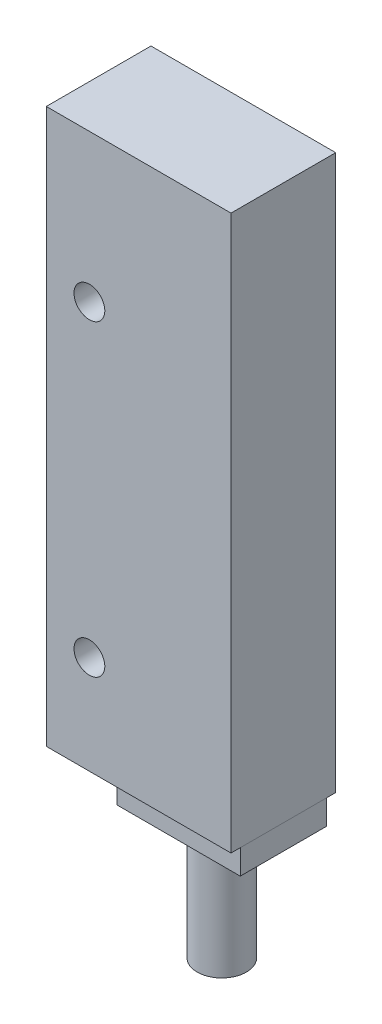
ISO-10303-21;
HEADER;
FILE_DESCRIPTION(('STEP AP214'),'2;1');
FILE_NAME('part.step','',(''),(''),'','','');
FILE_SCHEMA(('AUTOMOTIVE_DESIGN { 1 0 10303 214 1 1 1 1 }'));
ENDSEC;
DATA;
#1=APPLICATION_CONTEXT('core data for automotive mechanical design processes');
#2=APPLICATION_PROTOCOL_DEFINITION('international standard','automotive_design',2000,#1);
#3=PRODUCT_CONTEXT('',#1,'mechanical');
#4=PRODUCT('Part','Part','',(#3));
#5=PRODUCT_RELATED_PRODUCT_CATEGORY('part','',(#4));
#6=PRODUCT_DEFINITION_FORMATION('','',#4);
#7=PRODUCT_DEFINITION_CONTEXT('part definition',#1,'design');
#8=PRODUCT_DEFINITION('design','',#6,#7);
#9=PRODUCT_DEFINITION_SHAPE('','',#8);
#10=(LENGTH_UNIT() NAMED_UNIT(*) SI_UNIT(.MILLI.,.METRE.));
#11=(NAMED_UNIT(*) PLANE_ANGLE_UNIT() SI_UNIT($,.RADIAN.));
#12=(NAMED_UNIT(*) SI_UNIT($,.STERADIAN.) SOLID_ANGLE_UNIT());
#13=UNCERTAINTY_MEASURE_WITH_UNIT(LENGTH_MEASURE(1.E-05),#10,'distance_accuracy_value','');
#14=(GEOMETRIC_REPRESENTATION_CONTEXT(3) GLOBAL_UNCERTAINTY_ASSIGNED_CONTEXT((#13)) GLOBAL_UNIT_ASSIGNED_CONTEXT((#10,
#11,#12)) REPRESENTATION_CONTEXT('',''));
#15=CARTESIAN_POINT('',(0.,0.,0.));
#16=DIRECTION('',(0.,0.,1.));
#17=DIRECTION('',(1.,0.,0.));
#18=AXIS2_PLACEMENT_3D('',#15,#16,#17);
#19=CARTESIAN_POINT('',(2.22044604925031E-13,-24.4999999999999,3.49999999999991));
#20=DIRECTION('',(0.,0.999999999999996,0.));
#21=DIRECTION('',(0.,0.,0.999999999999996));
#22=AXIS2_PLACEMENT_3D('',#19,#20,#21);
#23=PLANE('',#22);
#24=DIRECTION('',(0.999999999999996,0.,0.));
#25=VECTOR('',#24,1.);
#26=CARTESIAN_POINT('',(-1.66533453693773E-13,-24.5,-3.49999999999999));
#27=LINE('',#26,#25);
#28=CARTESIAN_POINT('',(-9.99999999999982,-24.5000000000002,-3.5));
#29=VERTEX_POINT('',#28);
#30=CARTESIAN_POINT('',(-1.66533453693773E-13,-24.5,-3.49999999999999));
#31=VERTEX_POINT('',#30);
#32=EDGE_CURVE('E108',#29,#31,#27,.T.);
#33=ORIENTED_EDGE('',*,*,#32,.T.);
#34=DIRECTION('',(0.,0.,-0.999999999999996));
#35=VECTOR('',#34,1.);
#36=CARTESIAN_POINT('',(2.22044604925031E-13,-24.4999999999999,3.49999999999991));
#37=LINE('',#36,#35);
#38=CARTESIAN_POINT('',(2.22044604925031E-13,-24.4999999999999,3.49999999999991));
#39=VERTEX_POINT('',#38);
#40=EDGE_CURVE('E101',#39,#31,#37,.T.);
#41=ORIENTED_EDGE('',*,*,#40,.F.);
#42=DIRECTION('',(0.999999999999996,0.,0.));
#43=VECTOR('',#42,1.);
#44=CARTESIAN_POINT('',(2.22044604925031E-13,-24.4999999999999,3.49999999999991));
#45=LINE('',#44,#43);
#46=CARTESIAN_POINT('',(-10.,-24.5,3.49999999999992));
#47=VERTEX_POINT('',#46);
#48=EDGE_CURVE('E57',#47,#39,#45,.T.);
#49=ORIENTED_EDGE('',*,*,#48,.F.);
#50=DIRECTION('',(0.,0.,-0.999999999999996));
#51=VECTOR('',#50,1.);
#52=CARTESIAN_POINT('',(-10.,-24.5,3.49999999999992));
#53=LINE('',#52,#51);
#54=EDGE_CURVE('E116',#47,#29,#53,.T.);
#55=ORIENTED_EDGE('',*,*,#54,.T.);
#56=EDGE_LOOP('',(#33,#41,#49,#55));
#57=FACE_BOUND('',#56,.T.);
#58=CARTESIAN_POINT('',(-5.00000000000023,-24.5,0.));
#59=DIRECTION('',(0.,0.999999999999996,0.));
#60=DIRECTION('',(0.,0.,0.999999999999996));
#61=AXIS2_PLACEMENT_3D('',#58,#59,#60);
#62=CIRCLE('',#61,2.);
#63=CARTESIAN_POINT('',(-4.99999999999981,-24.5,1.99999999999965));
#64=VERTEX_POINT('',#63);
#65=EDGE_CURVE('E12',#64,#64,#62,.F.);
#66=ORIENTED_EDGE('',*,*,#65,.F.);
#67=EDGE_LOOP('',(#66));
#68=FACE_BOUND('',#67,.T.);
#69=ADVANCED_FACE('F42',(#57,#68),#23,.F.);
#70=CARTESIAN_POINT('',(0.,-22.5000000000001,3.50000000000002));
#71=DIRECTION('',(-0.999999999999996,0.,0.));
#72=DIRECTION('',(0.,-0.999999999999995,0.));
#73=AXIS2_PLACEMENT_3D('',#70,#71,#72);
#74=PLANE('',#73);
#75=DIRECTION('',(0.,0.999999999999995,0.));
#76=VECTOR('',#75,1.);
#77=CARTESIAN_POINT('',(-2.22044604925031E-13,-22.5,-3.49999999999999));
#78=LINE('',#77,#76);
#79=CARTESIAN_POINT('',(-2.22044604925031E-13,-22.5,-3.49999999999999));
#80=VERTEX_POINT('',#79);
#81=EDGE_CURVE('E88',#31,#80,#78,.T.);
#82=ORIENTED_EDGE('',*,*,#81,.T.);
#83=DIRECTION('',(0.,0.,-0.999999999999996));
#84=VECTOR('',#83,1.);
#85=CARTESIAN_POINT('',(0.,-22.5000000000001,3.50000000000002));
#86=LINE('',#85,#84);
#87=CARTESIAN_POINT('',(0.,-22.5000000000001,3.50000000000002));
#88=VERTEX_POINT('',#87);
#89=EDGE_CURVE('E50',#88,#80,#86,.T.);
#90=ORIENTED_EDGE('',*,*,#89,.F.);
#91=DIRECTION('',(0.,0.999999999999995,0.));
#92=VECTOR('',#91,1.);
#93=CARTESIAN_POINT('',(0.,-22.5000000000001,3.50000000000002));
#94=LINE('',#93,#92);
#95=EDGE_CURVE('E110',#39,#88,#94,.T.);
#96=ORIENTED_EDGE('',*,*,#95,.F.);
#97=ORIENTED_EDGE('',*,*,#40,.T.);
#98=EDGE_LOOP('',(#82,#90,#96,#97));
#99=FACE_BOUND('',#98,.T.);
#100=ADVANCED_FACE('F44',(#99),#74,.F.);
#101=CARTESIAN_POINT('',(0.,-22.5000000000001,3.50000000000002));
#102=DIRECTION('',(0.,-0.999999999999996,0.));
#103=DIRECTION('',(0.,0.,-0.999999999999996));
#104=AXIS2_PLACEMENT_3D('',#101,#102,#103);
#105=PLANE('',#104);
#106=DIRECTION('',(-0.999999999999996,0.,0.));
#107=VECTOR('',#106,1.);
#108=CARTESIAN_POINT('',(-2.22044604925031E-13,-22.5,-3.49999999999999));
#109=LINE('',#108,#107);
#110=CARTESIAN_POINT('',(-10.,-22.5,-3.5));
#111=VERTEX_POINT('',#110);
#112=EDGE_CURVE('E83',#80,#111,#109,.T.);
#113=ORIENTED_EDGE('',*,*,#112,.T.);
#114=DIRECTION('',(0.,0.,-0.999999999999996));
#115=VECTOR('',#114,1.);
#116=CARTESIAN_POINT('',(-10.0000000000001,-22.5000000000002,3.49999999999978));
#117=LINE('',#116,#115);
#118=CARTESIAN_POINT('',(-10.0000000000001,-22.5000000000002,3.49999999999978));
#119=VERTEX_POINT('',#118);
#120=EDGE_CURVE('E99',#119,#111,#117,.T.);
#121=ORIENTED_EDGE('',*,*,#120,.F.);
#122=DIRECTION('',(-0.999999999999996,0.,0.));
#123=VECTOR('',#122,1.);
#124=CARTESIAN_POINT('',(0.,-22.5000000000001,3.50000000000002));
#125=LINE('',#124,#123);
#126=EDGE_CURVE('E96',#88,#119,#125,.T.);
#127=ORIENTED_EDGE('',*,*,#126,.F.);
#128=ORIENTED_EDGE('',*,*,#89,.T.);
#129=EDGE_LOOP('',(#113,#121,#127,#128));
#130=FACE_BOUND('',#129,.T.);
#131=ADVANCED_FACE('F95',(#130),#105,.F.);
#132=CARTESIAN_POINT('',(-10.0000000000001,-22.5000000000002,3.49999999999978));
#133=DIRECTION('',(0.999999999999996,0.,0.));
#134=DIRECTION('',(0.,0.999999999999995,0.));
#135=AXIS2_PLACEMENT_3D('',#132,#133,#134);
#136=PLANE('',#135);
#137=DIRECTION('',(0.,-0.999999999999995,0.));
#138=VECTOR('',#137,1.);
#139=CARTESIAN_POINT('',(-10.,-22.5,-3.5));
#140=LINE('',#139,#138);
#141=EDGE_CURVE('E89',#111,#29,#140,.T.);
#142=ORIENTED_EDGE('',*,*,#141,.T.);
#143=ORIENTED_EDGE('',*,*,#54,.F.);
#144=DIRECTION('',(0.,-0.999999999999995,0.));
#145=VECTOR('',#144,1.);
#146=CARTESIAN_POINT('',(-10.0000000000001,-22.5000000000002,3.49999999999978));
#147=LINE('',#146,#145);
#148=EDGE_CURVE('E62',#119,#47,#147,.T.);
#149=ORIENTED_EDGE('',*,*,#148,.F.);
#150=ORIENTED_EDGE('',*,*,#120,.T.);
#151=EDGE_LOOP('',(#142,#143,#149,#150));
#152=FACE_BOUND('',#151,.T.);
#153=ADVANCED_FACE('F120',(#152),#136,.F.);
#154=CARTESIAN_POINT('',(2.22044604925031E-13,-24.4999999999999,3.49999999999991));
#155=DIRECTION('',(0.,0.,-0.999999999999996));
#156=DIRECTION('',(-0.999999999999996,0.,0.));
#157=AXIS2_PLACEMENT_3D('',#154,#155,#156);
#158=PLANE('',#157);
#159=ORIENTED_EDGE('',*,*,#95,.T.);
#160=ORIENTED_EDGE('',*,*,#126,.T.);
#161=ORIENTED_EDGE('',*,*,#148,.T.);
#162=ORIENTED_EDGE('',*,*,#48,.T.);
#163=EDGE_LOOP('',(#159,#160,#161,#162));
#164=FACE_BOUND('',#163,.T.);
#165=ADVANCED_FACE('F123',(#164),#158,.F.);
#166=CARTESIAN_POINT('',(-1.66533453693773E-13,-24.5,-3.49999999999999));
#167=DIRECTION('',(0.,0.,-0.999999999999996));
#168=DIRECTION('',(-0.999999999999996,0.,0.));
#169=AXIS2_PLACEMENT_3D('',#166,#167,#168);
#170=PLANE('',#169);
#171=ORIENTED_EDGE('',*,*,#81,.F.);
#172=ORIENTED_EDGE('',*,*,#32,.F.);
#173=ORIENTED_EDGE('',*,*,#141,.F.);
#174=ORIENTED_EDGE('',*,*,#112,.F.);
#175=EDGE_LOOP('',(#171,#172,#173,#174));
#176=FACE_BOUND('',#175,.T.);
#177=ADVANCED_FACE('F85',(#176),#170,.T.);
#178=CARTESIAN_POINT('',(-4.99999999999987,-34.5,-3.46944695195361E-13));
#179=DIRECTION('',(0.,0.999999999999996,0.));
#180=DIRECTION('',(0.,0.,0.999999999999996));
#181=AXIS2_PLACEMENT_3D('',#178,#179,#180);
#182=CYLINDRICAL_SURFACE('',#181,2.);
#183=CARTESIAN_POINT('',(-4.99999999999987,-34.5,-3.46944695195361E-13));
#184=DIRECTION('',(0.,-0.999999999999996,0.));
#185=DIRECTION('',(0.,0.,-0.999999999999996));
#186=AXIS2_PLACEMENT_3D('',#183,#184,#185);
#187=CIRCLE('',#186,2.);
#188=CARTESIAN_POINT('',(-4.99999999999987,-34.5,1.99999999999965));
#189=VERTEX_POINT('',#188);
#190=EDGE_CURVE('E102',#189,#189,#187,.T.);
#191=CARTESIAN_POINT('',(-4.99999999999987,-34.5,1.99999999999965));
#192=CARTESIAN_POINT('',(-4.99999999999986,-34.3958333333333,1.99999999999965));
#193=CARTESIAN_POINT('',(-4.99999999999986,-34.2916666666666,1.99999999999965));
#194=CARTESIAN_POINT('',(-4.99999999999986,-34.0833333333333,1.99999999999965));
#195=CARTESIAN_POINT('',(-4.99999999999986,-33.9791666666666,1.99999999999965));
#196=CARTESIAN_POINT('',(-4.99999999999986,-33.7708333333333,1.99999999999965));
#197=CARTESIAN_POINT('',(-4.99999999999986,-33.6666666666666,1.99999999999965));
#198=CARTESIAN_POINT('',(-4.99999999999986,-33.4583333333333,1.99999999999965));
#199=CARTESIAN_POINT('',(-4.99999999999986,-33.3541666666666,1.99999999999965));
#200=CARTESIAN_POINT('',(-4.99999999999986,-33.1458333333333,1.99999999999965));
#201=CARTESIAN_POINT('',(-4.99999999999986,-33.0416666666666,1.99999999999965));
#202=CARTESIAN_POINT('',(-4.99999999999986,-32.8333333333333,1.99999999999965));
#203=CARTESIAN_POINT('',(-4.99999999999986,-32.7291666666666,1.99999999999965));
#204=CARTESIAN_POINT('',(-4.99999999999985,-32.5208333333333,1.99999999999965));
#205=CARTESIAN_POINT('',(-4.99999999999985,-32.4166666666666,1.99999999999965));
#206=CARTESIAN_POINT('',(-4.99999999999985,-32.2083333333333,1.99999999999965));
#207=CARTESIAN_POINT('',(-4.99999999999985,-32.1041666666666,1.99999999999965));
#208=CARTESIAN_POINT('',(-4.99999999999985,-31.8958333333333,1.99999999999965));
#209=CARTESIAN_POINT('',(-4.99999999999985,-31.7916666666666,1.99999999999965));
#210=CARTESIAN_POINT('',(-4.99999999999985,-31.5833333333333,1.99999999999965));
#211=CARTESIAN_POINT('',(-4.99999999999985,-31.4791666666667,1.99999999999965));
#212=CARTESIAN_POINT('',(-4.99999999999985,-31.2708333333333,1.99999999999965));
#213=CARTESIAN_POINT('',(-4.99999999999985,-31.1666666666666,1.99999999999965));
#214=CARTESIAN_POINT('',(-4.99999999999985,-30.9583333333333,1.99999999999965));
#215=CARTESIAN_POINT('',(-4.99999999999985,-30.8541666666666,1.99999999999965));
#216=CARTESIAN_POINT('',(-4.99999999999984,-30.6458333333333,1.99999999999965));
#217=CARTESIAN_POINT('',(-4.99999999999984,-30.5416666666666,1.99999999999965));
#218=CARTESIAN_POINT('',(-4.99999999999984,-30.3333333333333,1.99999999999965));
#219=CARTESIAN_POINT('',(-4.99999999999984,-30.2291666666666,1.99999999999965));
#220=CARTESIAN_POINT('',(-4.99999999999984,-30.0208333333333,1.99999999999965));
#221=CARTESIAN_POINT('',(-4.99999999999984,-29.9166666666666,1.99999999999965));
#222=CARTESIAN_POINT('',(-4.99999999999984,-29.7083333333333,1.99999999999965));
#223=CARTESIAN_POINT('',(-4.99999999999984,-29.6041666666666,1.99999999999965));
#224=CARTESIAN_POINT('',(-4.99999999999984,-29.3958333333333,1.99999999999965));
#225=CARTESIAN_POINT('',(-4.99999999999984,-29.2916666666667,1.99999999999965));
#226=CARTESIAN_POINT('',(-4.99999999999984,-29.0833333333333,1.99999999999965));
#227=CARTESIAN_POINT('',(-4.99999999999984,-28.9791666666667,1.99999999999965));
#228=CARTESIAN_POINT('',(-4.99999999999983,-28.7708333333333,1.99999999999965));
#229=CARTESIAN_POINT('',(-4.99999999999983,-28.6666666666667,1.99999999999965));
#230=CARTESIAN_POINT('',(-4.99999999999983,-28.4583333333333,1.99999999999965));
#231=CARTESIAN_POINT('',(-4.99999999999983,-28.3541666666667,1.99999999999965));
#232=CARTESIAN_POINT('',(-4.99999999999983,-28.1458333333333,1.99999999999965));
#233=CARTESIAN_POINT('',(-4.99999999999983,-28.0416666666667,1.99999999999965));
#234=CARTESIAN_POINT('',(-4.99999999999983,-27.8333333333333,1.99999999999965));
#235=CARTESIAN_POINT('',(-4.99999999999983,-27.7291666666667,1.99999999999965));
#236=CARTESIAN_POINT('',(-4.99999999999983,-27.5208333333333,1.99999999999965));
#237=CARTESIAN_POINT('',(-4.99999999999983,-27.4166666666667,1.99999999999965));
#238=CARTESIAN_POINT('',(-4.99999999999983,-27.2083333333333,1.99999999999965));
#239=CARTESIAN_POINT('',(-4.99999999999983,-27.1041666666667,1.99999999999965));
#240=CARTESIAN_POINT('',(-4.99999999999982,-26.8958333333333,1.99999999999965));
#241=CARTESIAN_POINT('',(-4.99999999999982,-26.7916666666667,1.99999999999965));
#242=CARTESIAN_POINT('',(-4.99999999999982,-26.5833333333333,1.99999999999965));
#243=CARTESIAN_POINT('',(-4.99999999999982,-26.4791666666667,1.99999999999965));
#244=CARTESIAN_POINT('',(-4.99999999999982,-26.2708333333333,1.99999999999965));
#245=CARTESIAN_POINT('',(-4.99999999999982,-26.1666666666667,1.99999999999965));
#246=CARTESIAN_POINT('',(-4.99999999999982,-25.9583333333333,1.99999999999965));
#247=CARTESIAN_POINT('',(-4.99999999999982,-25.8541666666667,1.99999999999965));
#248=CARTESIAN_POINT('',(-4.99999999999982,-25.6458333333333,1.99999999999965));
#249=CARTESIAN_POINT('',(-4.99999999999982,-25.5416666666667,1.99999999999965));
#250=CARTESIAN_POINT('',(-4.99999999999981,-25.3333333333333,1.99999999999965));
#251=CARTESIAN_POINT('',(-4.99999999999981,-25.2291666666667,1.99999999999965));
#252=CARTESIAN_POINT('',(-4.99999999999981,-25.0208333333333,1.99999999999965));
#253=CARTESIAN_POINT('',(-4.99999999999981,-24.9166666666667,1.99999999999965));
#254=CARTESIAN_POINT('',(-4.99999999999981,-24.7083333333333,1.99999999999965));
#255=CARTESIAN_POINT('',(-4.99999999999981,-24.6041666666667,1.99999999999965));
#256=CARTESIAN_POINT('',(-4.99999999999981,-24.5,1.99999999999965));
#257=B_SPLINE_CURVE_WITH_KNOTS('',3,(#191,#192,#193,#194,#195,#196,#197,#198,#199,#200,#201,
#202,#203,#204,#205,#206,#207,#208,#209,#210,#211,#212,#213,#214,#215,#216,#217,#218,#219,#220,
#221,#222,#223,#224,#225,#226,#227,#228,#229,#230,#231,#232,#233,#234,#235,#236,#237,#238,#239,
#240,#241,#242,#243,#244,#245,#246,#247,#248,#249,#250,#251,#252,#253,#254,#255,#256),
.UNSPECIFIED.,.F.,.F.,(4,2,2,2,2,2,2,2,2,2,2,2,2,2,2,2,2,2,2,2,2,2,2,2,2,2,2,2,2,2,2,2,4),(0.,
0.312499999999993,0.624999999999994,0.937499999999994,1.24999999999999,1.56249999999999,
1.87499999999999,2.1875,2.5,2.81249999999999,3.12499999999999,3.43749999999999,3.74999999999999,
4.06249999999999,4.37499999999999,4.68749999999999,4.99999999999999,5.31249999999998,
5.62499999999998,5.93749999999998,6.24999999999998,6.56249999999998,6.87499999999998,
7.18749999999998,7.49999999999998,7.81249999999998,8.12499999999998,8.43749999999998,
8.74999999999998,9.06249999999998,9.37499999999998,9.68749999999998,9.99999999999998),.UNSPECIFIED.);
#258=EDGE_CURVE('BSEAM130',#189,#64,#257,.T.);
#259=ORIENTED_EDGE('',*,*,#190,.F.);
#260=ORIENTED_EDGE('',*,*,#65,.T.);
#261=ORIENTED_EDGE('',*,*,#258,.T.);
#262=ORIENTED_EDGE('',*,*,#258,.F.);
#263=EDGE_LOOP('',(#259,#261,#260,#262));
#264=FACE_BOUND('',#263,.T.);
#265=ADVANCED_FACE('F130',(#264),#182,.T.);
#266=CARTESIAN_POINT('',(-4.99999999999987,-34.5,-3.46944695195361E-13));
#267=DIRECTION('',(0.,-0.999999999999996,0.));
#268=DIRECTION('',(0.,0.,-0.999999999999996));
#269=AXIS2_PLACEMENT_3D('',#266,#267,#268);
#270=PLANE('',#269);
#271=ORIENTED_EDGE('',*,*,#190,.T.);
#272=EDGE_LOOP('',(#271));
#273=FACE_BOUND('',#272,.T.);
#274=ADVANCED_FACE('F167',(#273),#270,.T.);
#275=CLOSED_SHELL('',(#69,#100,#131,#153,#165,#177,#265,#274));
#276=MANIFOLD_SOLID_BREP('B2',#275);
#277=CARTESIAN_POINT('',(-14.9999999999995,22.5,4.25000000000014));
#278=DIRECTION('',(0.999999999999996,0.,0.));
#279=DIRECTION('',(0.,0.,-0.999999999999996));
#280=AXIS2_PLACEMENT_3D('',#277,#278,#279);
#281=PLANE('',#280);
#282=DIRECTION('',(0.,-0.999999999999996,0.));
#283=VECTOR('',#282,1.);
#284=CARTESIAN_POINT('',(-14.9999999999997,22.4999999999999,-4.24999999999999));
#285=LINE('',#284,#283);
#286=CARTESIAN_POINT('',(-14.9999999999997,22.4999999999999,-4.24999999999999));
#287=VERTEX_POINT('',#286);
#288=CARTESIAN_POINT('',(-15.0000000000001,-22.5000000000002,-4.24999999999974));
#289=VERTEX_POINT('',#288);
#290=EDGE_CURVE('E241',#287,#289,#285,.T.);
#291=ORIENTED_EDGE('',*,*,#290,.T.);
#292=DIRECTION('',(0.,0.,-0.999999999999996));
#293=VECTOR('',#292,1.);
#294=CARTESIAN_POINT('',(-15.,-22.5000000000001,4.25000000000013));
#295=LINE('',#294,#293);
#296=CARTESIAN_POINT('',(-15.,-22.5000000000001,4.25000000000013));
#297=VERTEX_POINT('',#296);
#298=EDGE_CURVE('E202',#297,#289,#295,.T.);
#299=ORIENTED_EDGE('',*,*,#298,.F.);
#300=DIRECTION('',(0.,-0.999999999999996,0.));
#301=VECTOR('',#300,1.);
#302=CARTESIAN_POINT('',(-14.9999999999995,22.5,4.25000000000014));
#303=LINE('',#302,#301);
#304=CARTESIAN_POINT('',(-14.9999999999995,22.5,4.25000000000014));
#305=VERTEX_POINT('',#304);
#306=EDGE_CURVE('E266',#305,#297,#303,.T.);
#307=ORIENTED_EDGE('',*,*,#306,.F.);
#308=DIRECTION('',(0.,0.,-0.999999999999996));
#309=VECTOR('',#308,1.);
#310=CARTESIAN_POINT('',(-14.9999999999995,22.5,4.25000000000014));
#311=LINE('',#310,#309);
#312=EDGE_CURVE('E255',#305,#287,#311,.T.);
#313=ORIENTED_EDGE('',*,*,#312,.T.);
#314=EDGE_LOOP('',(#291,#299,#307,#313));
#315=FACE_BOUND('',#314,.T.);
#316=CARTESIAN_POINT('',(-14.9999999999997,17.4999999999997,1.38777878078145E-13));
#317=DIRECTION('',(0.999999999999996,0.,0.));
#318=DIRECTION('',(0.,0.,-0.999999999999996));
#319=AXIS2_PLACEMENT_3D('',#316,#317,#318);
#320=CIRCLE('',#319,2.5);
#321=CARTESIAN_POINT('',(-14.9999999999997,17.4999999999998,-2.50000000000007));
#322=VERTEX_POINT('',#321);
#323=EDGE_CURVE('E40',#322,#322,#320,.F.);
#324=ORIENTED_EDGE('',*,*,#323,.F.);
#325=EDGE_LOOP('',(#324));
#326=FACE_BOUND('',#325,.T.);
#327=ADVANCED_FACE('F195',(#315,#326),#281,.F.);
#328=CARTESIAN_POINT('',(-15.,-22.5000000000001,4.25000000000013));
#329=DIRECTION('',(0.,0.,0.999999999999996));
#330=DIRECTION('',(0.999999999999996,0.,0.));
#331=AXIS2_PLACEMENT_3D('',#328,#329,#330);
#332=PLANE('',#331);
#333=CARTESIAN_POINT('',(-11.4999999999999,10.4999999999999,4.25000000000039));
#334=DIRECTION('',(0.,0.,0.999999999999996));
#335=DIRECTION('',(0.999999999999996,0.,0.));
#336=AXIS2_PLACEMENT_3D('',#333,#334,#335);
#337=CIRCLE('',#336,1.25);
#338=CARTESIAN_POINT('',(-12.7499999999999,10.4999999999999,4.25000000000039));
#339=VERTEX_POINT('',#338);
#340=EDGE_CURVE('E256',#339,#339,#337,.T.);
#341=ORIENTED_EDGE('',*,*,#340,.F.);
#342=EDGE_LOOP('',(#341));
#343=FACE_BOUND('',#342,.T.);
#344=ORIENTED_EDGE('',*,*,#306,.T.);
#345=DIRECTION('',(0.999999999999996,0.,0.));
#346=VECTOR('',#345,1.);
#347=CARTESIAN_POINT('',(-15.,-22.5000000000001,4.25000000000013));
#348=LINE('',#347,#346);
#349=CARTESIAN_POINT('',(-2.22044604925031E-13,-22.4999999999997,4.25));
#350=VERTEX_POINT('',#349);
#351=EDGE_CURVE('E249',#297,#350,#348,.T.);
#352=ORIENTED_EDGE('',*,*,#351,.T.);
#353=DIRECTION('',(0.,0.999999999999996,0.));
#354=VECTOR('',#353,1.);
#355=CARTESIAN_POINT('',(0.,22.5,4.25000000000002));
#356=LINE('',#355,#354);
#357=CARTESIAN_POINT('',(0.,22.5,4.25000000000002));
#358=VERTEX_POINT('',#357);
#359=EDGE_CURVE('E214',#350,#358,#356,.T.);
#360=ORIENTED_EDGE('',*,*,#359,.T.);
#361=DIRECTION('',(-0.999999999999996,0.,0.));
#362=VECTOR('',#361,1.);
#363=CARTESIAN_POINT('',(-14.9999999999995,22.5,4.25000000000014));
#364=LINE('',#363,#362);
#365=EDGE_CURVE('E209',#358,#305,#364,.T.);
#366=ORIENTED_EDGE('',*,*,#365,.T.);
#367=EDGE_LOOP('',(#344,#352,#360,#366));
#368=FACE_BOUND('',#367,.T.);
#369=CARTESIAN_POINT('',(-11.5,-14.5000000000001,4.24999999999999));
#370=DIRECTION('',(0.,0.,0.999999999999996));
#371=DIRECTION('',(0.999999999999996,0.,0.));
#372=AXIS2_PLACEMENT_3D('',#369,#370,#371);
#373=CIRCLE('',#372,1.25);
#374=CARTESIAN_POINT('',(-12.75,-14.5000000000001,4.24999999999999));
#375=VERTEX_POINT('',#374);
#376=EDGE_CURVE('E286',#375,#375,#373,.T.);
#377=ORIENTED_EDGE('',*,*,#376,.F.);
#378=EDGE_LOOP('',(#377));
#379=FACE_BOUND('',#378,.T.);
#380=ADVANCED_FACE('F279',(#343,#368,#379),#332,.T.);
#381=CARTESIAN_POINT('',(-15.0000000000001,-22.5000000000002,-4.24999999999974));
#382=DIRECTION('',(0.,0.,0.999999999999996));
#383=DIRECTION('',(0.999999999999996,0.,0.));
#384=AXIS2_PLACEMENT_3D('',#381,#382,#383);
#385=PLANE('',#384);
#386=CARTESIAN_POINT('',(-11.5000000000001,10.5,-4.25000000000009));
#387=DIRECTION('',(0.,0.,0.999999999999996));
#388=DIRECTION('',(0.999999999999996,0.,0.));
#389=AXIS2_PLACEMENT_3D('',#386,#387,#388);
#390=CIRCLE('',#389,1.25);
#391=CARTESIAN_POINT('',(-12.7499999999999,10.4999999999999,-4.25000000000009));
#392=VERTEX_POINT('',#391);
#393=EDGE_CURVE('E259',#392,#392,#390,.T.);
#394=ORIENTED_EDGE('',*,*,#393,.T.);
#395=EDGE_LOOP('',(#394));
#396=FACE_BOUND('',#395,.T.);
#397=ORIENTED_EDGE('',*,*,#290,.F.);
#398=DIRECTION('',(-0.999999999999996,0.,0.));
#399=VECTOR('',#398,1.);
#400=CARTESIAN_POINT('',(-14.9999999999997,22.4999999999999,-4.24999999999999));
#401=LINE('',#400,#399);
#402=CARTESIAN_POINT('',(2.4980018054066E-13,22.5,-4.25));
#403=VERTEX_POINT('',#402);
#404=EDGE_CURVE('E264',#403,#287,#401,.T.);
#405=ORIENTED_EDGE('',*,*,#404,.F.);
#406=DIRECTION('',(0.,0.999999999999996,0.));
#407=VECTOR('',#406,1.);
#408=CARTESIAN_POINT('',(2.4980018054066E-13,22.5,-4.25));
#409=LINE('',#408,#407);
#410=CARTESIAN_POINT('',(0.,-22.4999999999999,-4.24999999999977));
#411=VERTEX_POINT('',#410);
#412=EDGE_CURVE('E242',#411,#403,#409,.T.);
#413=ORIENTED_EDGE('',*,*,#412,.F.);
#414=DIRECTION('',(0.999999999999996,0.,0.));
#415=VECTOR('',#414,1.);
#416=CARTESIAN_POINT('',(-15.0000000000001,-22.5000000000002,-4.24999999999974));
#417=LINE('',#416,#415);
#418=EDGE_CURVE('E235',#289,#411,#417,.T.);
#419=ORIENTED_EDGE('',*,*,#418,.F.);
#420=EDGE_LOOP('',(#397,#405,#413,#419));
#421=FACE_BOUND('',#420,.T.);
#422=CARTESIAN_POINT('',(-11.4999999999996,-14.4999999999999,-4.24999999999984));
#423=DIRECTION('',(0.,0.,0.999999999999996));
#424=DIRECTION('',(0.999999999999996,0.,0.));
#425=AXIS2_PLACEMENT_3D('',#422,#423,#424);
#426=CIRCLE('',#425,1.25);
#427=CARTESIAN_POINT('',(-12.75,-14.5000000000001,-4.24999999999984));
#428=VERTEX_POINT('',#427);
#429=EDGE_CURVE('E288',#428,#428,#426,.T.);
#430=ORIENTED_EDGE('',*,*,#429,.T.);
#431=EDGE_LOOP('',(#430));
#432=FACE_BOUND('',#431,.T.);
#433=ADVANCED_FACE('F237',(#396,#421,#432),#385,.F.);
#434=CARTESIAN_POINT('',(-15.,-22.5000000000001,4.25000000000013));
#435=DIRECTION('',(0.,0.999999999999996,0.));
#436=DIRECTION('',(0.,0.,0.999999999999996));
#437=AXIS2_PLACEMENT_3D('',#434,#435,#436);
#438=PLANE('',#437);
#439=ORIENTED_EDGE('',*,*,#418,.T.);
#440=DIRECTION('',(0.,0.,-0.999999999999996));
#441=VECTOR('',#440,1.);
#442=CARTESIAN_POINT('',(-2.22044604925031E-13,-22.4999999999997,4.25));
#443=LINE('',#442,#441);
#444=EDGE_CURVE('E252',#350,#411,#443,.T.);
#445=ORIENTED_EDGE('',*,*,#444,.F.);
#446=ORIENTED_EDGE('',*,*,#351,.F.);
#447=ORIENTED_EDGE('',*,*,#298,.T.);
#448=EDGE_LOOP('',(#439,#445,#446,#447));
#449=FACE_BOUND('',#448,.T.);
#450=ADVANCED_FACE('F248',(#449),#438,.F.);
#451=CARTESIAN_POINT('',(0.,22.5,4.25000000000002));
#452=DIRECTION('',(-0.999999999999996,0.,0.));
#453=DIRECTION('',(0.,0.,0.999999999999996));
#454=AXIS2_PLACEMENT_3D('',#451,#452,#453);
#455=PLANE('',#454);
#456=ORIENTED_EDGE('',*,*,#412,.T.);
#457=DIRECTION('',(0.,0.,-0.999999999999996));
#458=VECTOR('',#457,1.);
#459=CARTESIAN_POINT('',(0.,22.5,4.25000000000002));
#460=LINE('',#459,#458);
#461=EDGE_CURVE('E272',#358,#403,#460,.T.);
#462=ORIENTED_EDGE('',*,*,#461,.F.);
#463=ORIENTED_EDGE('',*,*,#359,.F.);
#464=ORIENTED_EDGE('',*,*,#444,.T.);
#465=EDGE_LOOP('',(#456,#462,#463,#464));
#466=FACE_BOUND('',#465,.T.);
#467=ADVANCED_FACE('F276',(#466),#455,.F.);
#468=CARTESIAN_POINT('',(-14.9999999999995,22.5,4.25000000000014));
#469=DIRECTION('',(0.,-0.999999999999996,0.));
#470=DIRECTION('',(0.,0.,-0.999999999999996));
#471=AXIS2_PLACEMENT_3D('',#468,#469,#470);
#472=PLANE('',#471);
#473=ORIENTED_EDGE('',*,*,#404,.T.);
#474=ORIENTED_EDGE('',*,*,#312,.F.);
#475=ORIENTED_EDGE('',*,*,#365,.F.);
#476=ORIENTED_EDGE('',*,*,#461,.T.);
#477=EDGE_LOOP('',(#473,#474,#475,#476));
#478=FACE_BOUND('',#477,.T.);
#479=ADVANCED_FACE('F278',(#478),#472,.F.);
#480=CARTESIAN_POINT('',(-11.4999999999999,10.4999999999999,4.25000000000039));
#481=DIRECTION('',(0.,0.,-0.999999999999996));
#482=DIRECTION('',(-0.999999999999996,0.,0.));
#483=AXIS2_PLACEMENT_3D('',#480,#481,#482);
#484=CYLINDRICAL_SURFACE('',#483,1.25);
#485=CARTESIAN_POINT('',(-12.7499999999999,10.4999999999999,4.25000000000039));
#486=CARTESIAN_POINT('',(-12.7499999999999,10.4999999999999,4.16145833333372));
#487=CARTESIAN_POINT('',(-12.7499999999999,10.4999999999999,4.07291666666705));
#488=CARTESIAN_POINT('',(-12.7499999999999,10.4999999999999,3.89583333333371));
#489=CARTESIAN_POINT('',(-12.7499999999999,10.4999999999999,3.80729166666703));
#490=CARTESIAN_POINT('',(-12.7499999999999,10.4999999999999,3.63020833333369));
#491=CARTESIAN_POINT('',(-12.7499999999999,10.4999999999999,3.54166666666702));
#492=CARTESIAN_POINT('',(-12.7499999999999,10.4999999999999,3.36458333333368));
#493=CARTESIAN_POINT('',(-12.7499999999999,10.4999999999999,3.276041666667));
#494=CARTESIAN_POINT('',(-12.7499999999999,10.4999999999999,3.09895833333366));
#495=CARTESIAN_POINT('',(-12.7499999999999,10.4999999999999,3.01041666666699));
#496=CARTESIAN_POINT('',(-12.7499999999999,10.4999999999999,2.83333333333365));
#497=CARTESIAN_POINT('',(-12.7499999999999,10.4999999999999,2.74479166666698));
#498=CARTESIAN_POINT('',(-12.7499999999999,10.4999999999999,2.56770833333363));
#499=CARTESIAN_POINT('',(-12.7499999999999,10.4999999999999,2.47916666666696));
#500=CARTESIAN_POINT('',(-12.7499999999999,10.4999999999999,2.30208333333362));
#501=CARTESIAN_POINT('',(-12.7499999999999,10.4999999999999,2.21354166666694));
#502=CARTESIAN_POINT('',(-12.7499999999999,10.4999999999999,2.0364583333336));
#503=CARTESIAN_POINT('',(-12.7499999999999,10.4999999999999,1.94791666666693));
#504=CARTESIAN_POINT('',(-12.7499999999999,10.4999999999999,1.77083333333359));
#505=CARTESIAN_POINT('',(-12.7499999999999,10.4999999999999,1.68229166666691));
#506=CARTESIAN_POINT('',(-12.7499999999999,10.4999999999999,1.50520833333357));
#507=CARTESIAN_POINT('',(-12.7499999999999,10.4999999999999,1.4166666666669));
#508=CARTESIAN_POINT('',(-12.7499999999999,10.4999999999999,1.23958333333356));
#509=CARTESIAN_POINT('',(-12.7499999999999,10.4999999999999,1.15104166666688));
#510=CARTESIAN_POINT('',(-12.7499999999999,10.4999999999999,0.973958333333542));
#511=CARTESIAN_POINT('',(-12.7499999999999,10.4999999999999,0.88541666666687));
#512=CARTESIAN_POINT('',(-12.7499999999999,10.4999999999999,0.708333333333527));
#513=CARTESIAN_POINT('',(-12.7499999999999,10.4999999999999,0.619791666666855));
#514=CARTESIAN_POINT('',(-12.7499999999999,10.4999999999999,0.442708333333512));
#515=CARTESIAN_POINT('',(-12.7499999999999,10.4999999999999,0.35416666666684));
#516=CARTESIAN_POINT('',(-12.7499999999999,10.4999999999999,0.177083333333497));
#517=CARTESIAN_POINT('',(-12.7499999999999,10.4999999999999,0.0885416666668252));
#518=CARTESIAN_POINT('',(-12.7499999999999,10.4999999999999,-0.0885416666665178));
#519=CARTESIAN_POINT('',(-12.7499999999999,10.4999999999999,-0.177083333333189));
#520=CARTESIAN_POINT('',(-12.7499999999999,10.4999999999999,-0.354166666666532));
#521=CARTESIAN_POINT('',(-12.7499999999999,10.4999999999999,-0.442708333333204));
#522=CARTESIAN_POINT('',(-12.7499999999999,10.4999999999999,-0.619791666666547));
#523=CARTESIAN_POINT('',(-12.7499999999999,10.4999999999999,-0.708333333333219));
#524=CARTESIAN_POINT('',(-12.7499999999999,10.4999999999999,-0.885416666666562));
#525=CARTESIAN_POINT('',(-12.7499999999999,10.4999999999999,-0.973958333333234));
#526=CARTESIAN_POINT('',(-12.7499999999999,10.4999999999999,-1.15104166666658));
#527=CARTESIAN_POINT('',(-12.7499999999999,10.4999999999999,-1.23958333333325));
#528=CARTESIAN_POINT('',(-12.7499999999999,10.4999999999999,-1.41666666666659));
#529=CARTESIAN_POINT('',(-12.7499999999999,10.4999999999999,-1.50520833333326));
#530=CARTESIAN_POINT('',(-12.7499999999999,10.4999999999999,-1.68229166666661));
#531=CARTESIAN_POINT('',(-12.7499999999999,10.4999999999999,-1.77083333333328));
#532=CARTESIAN_POINT('',(-12.7499999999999,10.4999999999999,-1.94791666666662));
#533=CARTESIAN_POINT('',(-12.7499999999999,10.4999999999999,-2.03645833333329));
#534=CARTESIAN_POINT('',(-12.7499999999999,10.4999999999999,-2.21354166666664));
#535=CARTESIAN_POINT('',(-12.7499999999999,10.4999999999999,-2.30208333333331));
#536=CARTESIAN_POINT('',(-12.7499999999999,10.4999999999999,-2.47916666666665));
#537=CARTESIAN_POINT('',(-12.7499999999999,10.4999999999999,-2.56770833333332));
#538=CARTESIAN_POINT('',(-12.7499999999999,10.4999999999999,-2.74479166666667));
#539=CARTESIAN_POINT('',(-12.7499999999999,10.4999999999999,-2.83333333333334));
#540=CARTESIAN_POINT('',(-12.7499999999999,10.4999999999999,-3.01041666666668));
#541=CARTESIAN_POINT('',(-12.7499999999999,10.4999999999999,-3.09895833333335));
#542=CARTESIAN_POINT('',(-12.7499999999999,10.4999999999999,-3.2760416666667));
#543=CARTESIAN_POINT('',(-12.7499999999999,10.4999999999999,-3.36458333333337));
#544=CARTESIAN_POINT('',(-12.7499999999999,10.4999999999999,-3.54166666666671));
#545=CARTESIAN_POINT('',(-12.7499999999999,10.4999999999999,-3.63020833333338));
#546=CARTESIAN_POINT('',(-12.7499999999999,10.4999999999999,-3.80729166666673));
#547=CARTESIAN_POINT('',(-12.7499999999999,10.4999999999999,-3.8958333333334));
#548=CARTESIAN_POINT('',(-12.7499999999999,10.4999999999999,-4.07291666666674));
#549=CARTESIAN_POINT('',(-12.7499999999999,10.4999999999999,-4.16145833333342));
#550=CARTESIAN_POINT('',(-12.7499999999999,10.4999999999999,-4.25000000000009));
#551=B_SPLINE_CURVE_WITH_KNOTS('',3,(#485,#486,#487,#488,#489,#490,#491,#492,#493,#494,#495,
#496,#497,#498,#499,#500,#501,#502,#503,#504,#505,#506,#507,#508,#509,#510,#511,#512,#513,#514,
#515,#516,#517,#518,#519,#520,#521,#522,#523,#524,#525,#526,#527,#528,#529,#530,#531,#532,#533,
#534,#535,#536,#537,#538,#539,#540,#541,#542,#543,#544,#545,#546,#547,#548,#549,#550),
.UNSPECIFIED.,.F.,.F.,(4,2,2,2,2,2,2,2,2,2,2,2,2,2,2,2,2,2,2,2,2,2,2,2,2,2,2,2,2,2,2,2,4),(0.,
0.265625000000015,0.53125000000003,0.796875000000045,1.06250000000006,1.32812500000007,
1.59375000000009,1.85937500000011,2.12500000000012,2.39062500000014,2.65625000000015,
2.92187500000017,3.18750000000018,3.45312500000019,3.71875000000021,3.98437500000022,
4.25000000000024,4.51562500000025,4.78125000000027,5.04687500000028,5.3125000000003,
5.57812500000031,5.84375000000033,6.10937500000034,6.37500000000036,6.64062500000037,
6.90625000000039,7.1718750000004,7.43750000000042,7.70312500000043,7.96875000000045,
8.23437500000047,8.50000000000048),.UNSPECIFIED.);
#552=EDGE_CURVE('BSEAM337',#339,#392,#551,.T.);
#553=ORIENTED_EDGE('',*,*,#340,.T.);
#554=ORIENTED_EDGE('',*,*,#393,.F.);
#555=ORIENTED_EDGE('',*,*,#552,.T.);
#556=ORIENTED_EDGE('',*,*,#552,.F.);
#557=EDGE_LOOP('',(#553,#555,#554,#556));
#558=FACE_BOUND('',#557,.T.);
#559=ADVANCED_FACE('F337',(#558),#484,.F.);
#560=CARTESIAN_POINT('',(-11.5,-14.5000000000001,4.24999999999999));
#561=DIRECTION('',(0.,0.,-0.999999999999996));
#562=DIRECTION('',(-0.999999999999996,0.,0.));
#563=AXIS2_PLACEMENT_3D('',#560,#561,#562);
#564=CYLINDRICAL_SURFACE('',#563,1.25);
#565=CARTESIAN_POINT('',(-12.75,-14.5000000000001,4.24999999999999));
#566=CARTESIAN_POINT('',(-12.75,-14.5000000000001,4.16145833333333));
#567=CARTESIAN_POINT('',(-12.75,-14.5000000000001,4.07291666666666));
#568=CARTESIAN_POINT('',(-12.75,-14.5000000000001,3.89583333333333));
#569=CARTESIAN_POINT('',(-12.75,-14.5000000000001,3.80729166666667));
#570=CARTESIAN_POINT('',(-12.75,-14.5000000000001,3.63020833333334));
#571=CARTESIAN_POINT('',(-12.75,-14.5000000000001,3.54166666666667));
#572=CARTESIAN_POINT('',(-12.75,-14.5000000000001,3.36458333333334));
#573=CARTESIAN_POINT('',(-12.75,-14.5000000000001,3.27604166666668));
#574=CARTESIAN_POINT('',(-12.75,-14.5000000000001,3.09895833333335));
#575=CARTESIAN_POINT('',(-12.75,-14.5000000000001,3.01041666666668));
#576=CARTESIAN_POINT('',(-12.75,-14.5000000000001,2.83333333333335));
#577=CARTESIAN_POINT('',(-12.75,-14.5000000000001,2.74479166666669));
#578=CARTESIAN_POINT('',(-12.75,-14.5000000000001,2.56770833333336));
#579=CARTESIAN_POINT('',(-12.75,-14.5000000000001,2.47916666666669));
#580=CARTESIAN_POINT('',(-12.75,-14.5000000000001,2.30208333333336));
#581=CARTESIAN_POINT('',(-12.75,-14.5000000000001,2.2135416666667));
#582=CARTESIAN_POINT('',(-12.75,-14.5000000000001,2.03645833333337));
#583=CARTESIAN_POINT('',(-12.75,-14.5000000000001,1.9479166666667));
#584=CARTESIAN_POINT('',(-12.75,-14.5000000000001,1.77083333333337));
#585=CARTESIAN_POINT('',(-12.75,-14.5000000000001,1.68229166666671));
#586=CARTESIAN_POINT('',(-12.75,-14.5000000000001,1.50520833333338));
#587=CARTESIAN_POINT('',(-12.75,-14.5000000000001,1.41666666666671));
#588=CARTESIAN_POINT('',(-12.75,-14.5000000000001,1.23958333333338));
#589=CARTESIAN_POINT('',(-12.75,-14.5000000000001,1.15104166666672));
#590=CARTESIAN_POINT('',(-12.75,-14.5000000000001,0.973958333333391));
#591=CARTESIAN_POINT('',(-12.75,-14.5000000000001,0.885416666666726));
#592=CARTESIAN_POINT('',(-12.75,-14.5000000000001,0.708333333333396));
#593=CARTESIAN_POINT('',(-12.75,-14.5000000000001,0.619791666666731));
#594=CARTESIAN_POINT('',(-12.75,-14.5000000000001,0.442708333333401));
#595=CARTESIAN_POINT('',(-12.75,-14.5000000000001,0.354166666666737));
#596=CARTESIAN_POINT('',(-12.75,-14.5000000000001,0.177083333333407));
#597=CARTESIAN_POINT('',(-12.75,-14.5000000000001,0.0885416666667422));
#598=CARTESIAN_POINT('',(-12.75,-14.5000000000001,-0.0885416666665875));
#599=CARTESIAN_POINT('',(-12.75,-14.5000000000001,-0.177083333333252));
#600=CARTESIAN_POINT('',(-12.75,-14.5000000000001,-0.354166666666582));
#601=CARTESIAN_POINT('',(-12.75,-14.5000000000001,-0.442708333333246));
#602=CARTESIAN_POINT('',(-12.75,-14.5000000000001,-0.619791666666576));
#603=CARTESIAN_POINT('',(-12.75,-14.5000000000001,-0.708333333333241));
#604=CARTESIAN_POINT('',(-12.75,-14.5000000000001,-0.885416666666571));
#605=CARTESIAN_POINT('',(-12.75,-14.5000000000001,-0.973958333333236));
#606=CARTESIAN_POINT('',(-12.75,-14.5000000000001,-1.15104166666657));
#607=CARTESIAN_POINT('',(-12.75,-14.5000000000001,-1.23958333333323));
#608=CARTESIAN_POINT('',(-12.75,-14.5000000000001,-1.41666666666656));
#609=CARTESIAN_POINT('',(-12.75,-14.5000000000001,-1.50520833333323));
#610=CARTESIAN_POINT('',(-12.75,-14.5000000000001,-1.68229166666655));
#611=CARTESIAN_POINT('',(-12.75,-14.5000000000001,-1.77083333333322));
#612=CARTESIAN_POINT('',(-12.75,-14.5000000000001,-1.94791666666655));
#613=CARTESIAN_POINT('',(-12.75,-14.5000000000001,-2.03645833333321));
#614=CARTESIAN_POINT('',(-12.75,-14.5000000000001,-2.21354166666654));
#615=CARTESIAN_POINT('',(-12.75,-14.5000000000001,-2.30208333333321));
#616=CARTESIAN_POINT('',(-12.75,-14.5000000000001,-2.47916666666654));
#617=CARTESIAN_POINT('',(-12.75,-14.5000000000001,-2.5677083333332));
#618=CARTESIAN_POINT('',(-12.75,-14.5000000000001,-2.74479166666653));
#619=CARTESIAN_POINT('',(-12.75,-14.5000000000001,-2.8333333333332));
#620=CARTESIAN_POINT('',(-12.75,-14.5000000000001,-3.01041666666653));
#621=CARTESIAN_POINT('',(-12.75,-14.5000000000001,-3.09895833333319));
#622=CARTESIAN_POINT('',(-12.75,-14.5000000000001,-3.27604166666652));
#623=CARTESIAN_POINT('',(-12.75,-14.5000000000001,-3.36458333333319));
#624=CARTESIAN_POINT('',(-12.75,-14.5000000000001,-3.54166666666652));
#625=CARTESIAN_POINT('',(-12.75,-14.5000000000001,-3.63020833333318));
#626=CARTESIAN_POINT('',(-12.75,-14.5000000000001,-3.80729166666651));
#627=CARTESIAN_POINT('',(-12.75,-14.5000000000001,-3.89583333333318));
#628=CARTESIAN_POINT('',(-12.75,-14.5000000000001,-4.07291666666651));
#629=CARTESIAN_POINT('',(-12.75,-14.5000000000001,-4.16145833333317));
#630=CARTESIAN_POINT('',(-12.75,-14.5000000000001,-4.24999999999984));
#631=B_SPLINE_CURVE_WITH_KNOTS('',3,(#565,#566,#567,#568,#569,#570,#571,#572,#573,#574,#575,
#576,#577,#578,#579,#580,#581,#582,#583,#584,#585,#586,#587,#588,#589,#590,#591,#592,#593,#594,
#595,#596,#597,#598,#599,#600,#601,#602,#603,#604,#605,#606,#607,#608,#609,#610,#611,#612,#613,
#614,#615,#616,#617,#618,#619,#620,#621,#622,#623,#624,#625,#626,#627,#628,#629,#630),
.UNSPECIFIED.,.F.,.F.,(4,2,2,2,2,2,2,2,2,2,2,2,2,2,2,2,2,2,2,2,2,2,2,2,2,2,2,2,2,2,2,2,4),(0.,
0.265624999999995,0.53124999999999,0.796874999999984,1.06249999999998,1.32812499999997,
1.59374999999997,1.85937499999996,2.12499999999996,2.39062499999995,2.65624999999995,
2.92187499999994,3.18749999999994,3.45312499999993,3.71874999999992,3.98437499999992,
4.24999999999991,4.51562499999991,4.7812499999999,5.0468749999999,5.31249999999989,
5.57812499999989,5.84374999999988,6.10937499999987,6.37499999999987,6.64062499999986,
6.90624999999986,7.17187499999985,7.43749999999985,7.70312499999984,7.96874999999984,
8.23437499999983,8.49999999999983),.UNSPECIFIED.);
#632=EDGE_CURVE('BSEAM303',#375,#428,#631,.T.);
#633=ORIENTED_EDGE('',*,*,#376,.T.);
#634=ORIENTED_EDGE('',*,*,#429,.F.);
#635=ORIENTED_EDGE('',*,*,#632,.T.);
#636=ORIENTED_EDGE('',*,*,#632,.F.);
#637=EDGE_LOOP('',(#633,#635,#634,#636));
#638=FACE_BOUND('',#637,.T.);
#639=ADVANCED_FACE('F303',(#638),#564,.F.);
#640=CARTESIAN_POINT('',(-15.4999999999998,17.4999999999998,0.));
#641=DIRECTION('',(0.999999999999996,0.,0.));
#642=DIRECTION('',(0.,0.,-0.999999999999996));
#643=AXIS2_PLACEMENT_3D('',#640,#641,#642);
#644=CYLINDRICAL_SURFACE('',#643,2.5);
#645=CARTESIAN_POINT('',(-15.4999999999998,17.4999999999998,0.));
#646=DIRECTION('',(-0.999999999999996,0.,0.));
#647=DIRECTION('',(0.,0.,0.999999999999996));
#648=AXIS2_PLACEMENT_3D('',#645,#646,#647);
#649=CIRCLE('',#648,2.5);
#650=CARTESIAN_POINT('',(-15.4999999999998,17.4999999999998,-2.50000000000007));
#651=VERTEX_POINT('',#650);
#652=EDGE_CURVE('E292',#651,#651,#649,.T.);
#653=CARTESIAN_POINT('',(-15.4999999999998,17.4999999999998,-2.50000000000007));
#654=CARTESIAN_POINT('',(-15.4947916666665,17.4999999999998,-2.50000000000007));
#655=CARTESIAN_POINT('',(-15.4895833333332,17.4999999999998,-2.50000000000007));
#656=CARTESIAN_POINT('',(-15.4791666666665,17.4999999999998,-2.50000000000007));
#657=CARTESIAN_POINT('',(-15.4739583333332,17.4999999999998,-2.50000000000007));
#658=CARTESIAN_POINT('',(-15.4635416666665,17.4999999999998,-2.50000000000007));
#659=CARTESIAN_POINT('',(-15.4583333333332,17.4999999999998,-2.50000000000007));
#660=CARTESIAN_POINT('',(-15.4479166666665,17.4999999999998,-2.50000000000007));
#661=CARTESIAN_POINT('',(-15.4427083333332,17.4999999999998,-2.50000000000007));
#662=CARTESIAN_POINT('',(-15.4322916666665,17.4999999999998,-2.50000000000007));
#663=CARTESIAN_POINT('',(-15.4270833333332,17.4999999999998,-2.50000000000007));
#664=CARTESIAN_POINT('',(-15.4166666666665,17.4999999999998,-2.50000000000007));
#665=CARTESIAN_POINT('',(-15.4114583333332,17.4999999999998,-2.50000000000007));
#666=CARTESIAN_POINT('',(-15.4010416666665,17.4999999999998,-2.50000000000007));
#667=CARTESIAN_POINT('',(-15.3958333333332,17.4999999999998,-2.50000000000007));
#668=CARTESIAN_POINT('',(-15.3854166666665,17.4999999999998,-2.50000000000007));
#669=CARTESIAN_POINT('',(-15.3802083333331,17.4999999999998,-2.50000000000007));
#670=CARTESIAN_POINT('',(-15.3697916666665,17.4999999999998,-2.50000000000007));
#671=CARTESIAN_POINT('',(-15.3645833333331,17.4999999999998,-2.50000000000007));
#672=CARTESIAN_POINT('',(-15.3541666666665,17.4999999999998,-2.50000000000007));
#673=CARTESIAN_POINT('',(-15.3489583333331,17.4999999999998,-2.50000000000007));
#674=CARTESIAN_POINT('',(-15.3385416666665,17.4999999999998,-2.50000000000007));
#675=CARTESIAN_POINT('',(-15.3333333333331,17.4999999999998,-2.50000000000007));
#676=CARTESIAN_POINT('',(-15.3229166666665,17.4999999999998,-2.50000000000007));
#677=CARTESIAN_POINT('',(-15.3177083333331,17.4999999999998,-2.50000000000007));
#678=CARTESIAN_POINT('',(-15.3072916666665,17.4999999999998,-2.50000000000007));
#679=CARTESIAN_POINT('',(-15.3020833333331,17.4999999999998,-2.50000000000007));
#680=CARTESIAN_POINT('',(-15.2916666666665,17.4999999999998,-2.50000000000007));
#681=CARTESIAN_POINT('',(-15.2864583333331,17.4999999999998,-2.50000000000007));
#682=CARTESIAN_POINT('',(-15.2760416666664,17.4999999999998,-2.50000000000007));
#683=CARTESIAN_POINT('',(-15.2708333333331,17.4999999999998,-2.50000000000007));
#684=CARTESIAN_POINT('',(-15.2604166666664,17.4999999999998,-2.50000000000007));
#685=CARTESIAN_POINT('',(-15.2552083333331,17.4999999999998,-2.50000000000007));
#686=CARTESIAN_POINT('',(-15.2447916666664,17.4999999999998,-2.50000000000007));
#687=CARTESIAN_POINT('',(-15.2395833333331,17.4999999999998,-2.50000000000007));
#688=CARTESIAN_POINT('',(-15.2291666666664,17.4999999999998,-2.50000000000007));
#689=CARTESIAN_POINT('',(-15.2239583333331,17.4999999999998,-2.50000000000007));
#690=CARTESIAN_POINT('',(-15.2135416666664,17.4999999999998,-2.50000000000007));
#691=CARTESIAN_POINT('',(-15.2083333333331,17.4999999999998,-2.50000000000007));
#692=CARTESIAN_POINT('',(-15.1979166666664,17.4999999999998,-2.50000000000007));
#693=CARTESIAN_POINT('',(-15.1927083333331,17.4999999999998,-2.50000000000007));
#694=CARTESIAN_POINT('',(-15.1822916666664,17.4999999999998,-2.50000000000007));
#695=CARTESIAN_POINT('',(-15.1770833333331,17.4999999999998,-2.50000000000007));
#696=CARTESIAN_POINT('',(-15.1666666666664,17.4999999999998,-2.50000000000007));
#697=CARTESIAN_POINT('',(-15.1614583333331,17.4999999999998,-2.50000000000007));
#698=CARTESIAN_POINT('',(-15.1510416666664,17.4999999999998,-2.50000000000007));
#699=CARTESIAN_POINT('',(-15.1458333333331,17.4999999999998,-2.50000000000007));
#700=CARTESIAN_POINT('',(-15.1354166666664,17.4999999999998,-2.50000000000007));
#701=CARTESIAN_POINT('',(-15.1302083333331,17.4999999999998,-2.50000000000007));
#702=CARTESIAN_POINT('',(-15.1197916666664,17.4999999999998,-2.50000000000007));
#703=CARTESIAN_POINT('',(-15.1145833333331,17.4999999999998,-2.50000000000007));
#704=CARTESIAN_POINT('',(-15.1041666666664,17.4999999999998,-2.50000000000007));
#705=CARTESIAN_POINT('',(-15.0989583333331,17.4999999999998,-2.50000000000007));
#706=CARTESIAN_POINT('',(-15.0885416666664,17.4999999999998,-2.50000000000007));
#707=CARTESIAN_POINT('',(-15.0833333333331,17.4999999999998,-2.50000000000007));
#708=CARTESIAN_POINT('',(-15.0729166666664,17.4999999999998,-2.50000000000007));
#709=CARTESIAN_POINT('',(-15.0677083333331,17.4999999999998,-2.50000000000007));
#710=CARTESIAN_POINT('',(-15.0572916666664,17.4999999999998,-2.50000000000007));
#711=CARTESIAN_POINT('',(-15.0520833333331,17.4999999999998,-2.50000000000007));
#712=CARTESIAN_POINT('',(-15.0416666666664,17.4999999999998,-2.50000000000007));
#713=CARTESIAN_POINT('',(-15.036458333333,17.4999999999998,-2.50000000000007));
#714=CARTESIAN_POINT('',(-15.0260416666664,17.4999999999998,-2.50000000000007));
#715=CARTESIAN_POINT('',(-15.020833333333,17.4999999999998,-2.50000000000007));
#716=CARTESIAN_POINT('',(-15.0104166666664,17.4999999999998,-2.50000000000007));
#717=CARTESIAN_POINT('',(-15.005208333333,17.4999999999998,-2.50000000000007));
#718=CARTESIAN_POINT('',(-14.9999999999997,17.4999999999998,-2.50000000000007));
#719=B_SPLINE_CURVE_WITH_KNOTS('',3,(#653,#654,#655,#656,#657,#658,#659,#660,#661,#662,#663,
#664,#665,#666,#667,#668,#669,#670,#671,#672,#673,#674,#675,#676,#677,#678,#679,#680,#681,#682,
#683,#684,#685,#686,#687,#688,#689,#690,#691,#692,#693,#694,#695,#696,#697,#698,#699,#700,#701,
#702,#703,#704,#705,#706,#707,#708,#709,#710,#711,#712,#713,#714,#715,#716,#717,#718),
.UNSPECIFIED.,.F.,.F.,(4,2,2,2,2,2,2,2,2,2,2,2,2,2,2,2,2,2,2,2,2,2,2,2,2,2,2,2,2,2,2,2,4),(0.,
0.0156250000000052,0.0312500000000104,0.0468750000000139,0.0625000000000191,0.0781250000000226,
0.0937500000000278,0.109375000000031,0.125000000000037,0.14062500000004,0.156250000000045,
0.171875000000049,0.187500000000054,0.203125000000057,0.218750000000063,0.234375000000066,
0.250000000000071,0.265625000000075,0.28125000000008,0.296875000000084,0.312500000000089,
0.328125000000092,0.343750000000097,0.359375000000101,0.375000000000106,0.39062500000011,
0.406250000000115,0.421875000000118,0.437500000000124,0.453125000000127,0.468750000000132,
0.484375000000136,0.500000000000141),.UNSPECIFIED.);
#720=EDGE_CURVE('BSEAM300',#651,#322,#719,.T.);
#721=ORIENTED_EDGE('',*,*,#652,.F.);
#722=ORIENTED_EDGE('',*,*,#323,.T.);
#723=ORIENTED_EDGE('',*,*,#720,.T.);
#724=ORIENTED_EDGE('',*,*,#720,.F.);
#725=EDGE_LOOP('',(#721,#723,#722,#724));
#726=FACE_BOUND('',#725,.T.);
#727=ADVANCED_FACE('F300',(#726),#644,.T.);
#728=CARTESIAN_POINT('',(-15.4999999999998,17.4999999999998,0.));
#729=DIRECTION('',(-0.999999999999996,0.,0.));
#730=DIRECTION('',(0.,0.,0.999999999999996));
#731=AXIS2_PLACEMENT_3D('',#728,#729,#730);
#732=PLANE('',#731);
#733=ORIENTED_EDGE('',*,*,#652,.T.);
#734=EDGE_LOOP('',(#733));
#735=FACE_BOUND('',#734,.T.);
#736=ADVANCED_FACE('F298',(#735),#732,.T.);
#737=CLOSED_SHELL('',(#327,#380,#433,#450,#467,#479,#559,#639,#727,#736));
#738=MANIFOLD_SOLID_BREP('B6',#737);
#739=ADVANCED_BREP_SHAPE_REPRESENTATION('',(#18,#276,#738),#14);
#740=SHAPE_DEFINITION_REPRESENTATION(#9,#739);
ENDSEC;
END-ISO-10303-21;
